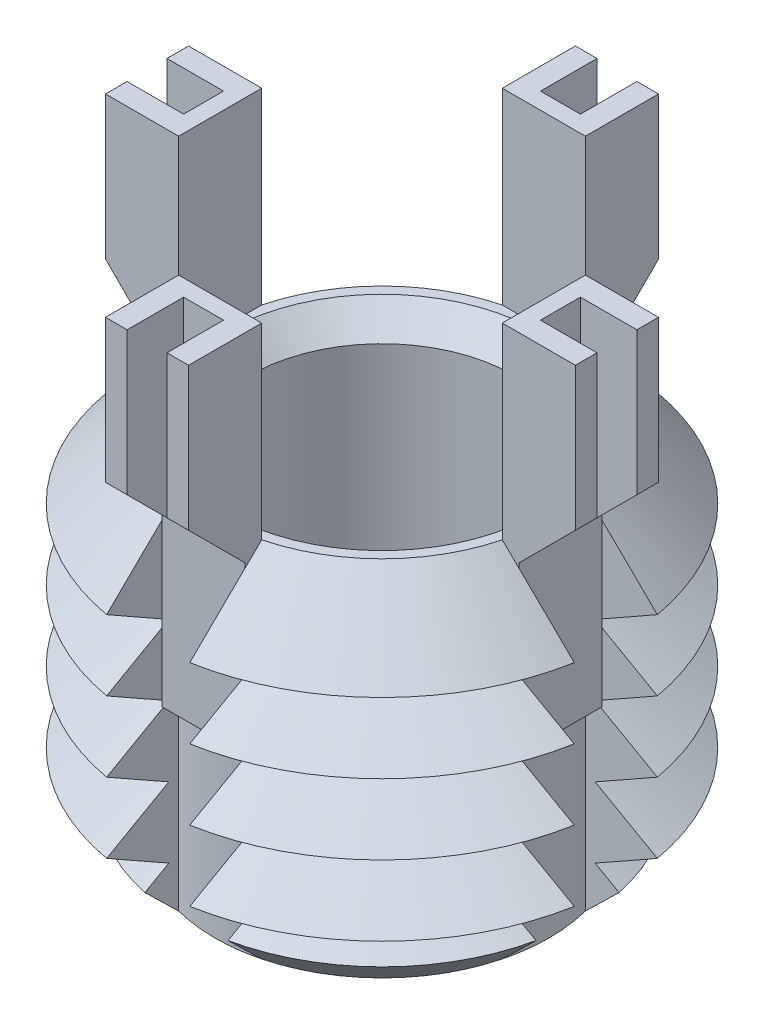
from build123d import *

# Parameters (mm, degrees)
SKETCH1_R               = 7.144
BOSS_EXTRUDE1_DEPTH     = 10.922
CHAMFER1_SIZE           = 2.117
LPATTERN1_COUNT         = 4
LPATTERN1_PITCH         = 2.117
CUT_EXTRUDE1_REACH      = 16.878
CIRPATTERN1_COUNT       = 4
BOSS_EXTRUDE3_DEPTH     = 1.25
CIRPATTERN2_COUNT       = 4
CUT_EXTRUDE3_DEPTH      = 20.353104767
CUT_EXTRUDE3_DEPTH_BACK = 20.353104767
SKETCH6_W               = 1.7
SKETCH6_H               = 1.2
SKETCH6_W_2             = 1.2
SKETCH6_H_2             = 1.7
SKETCH7_R               = 3.969
CUT_EXTRUDE4_DEPTH      = 10.922
CHAMFER2_SIZE           = 0.755


with BuildPart() as part:
    # Sketch1 → Boss-Extrude1 (new body)
    with BuildSketch(Plane(origin=(0, 0, 0), x_dir=(1, 0, 0), z_dir=(0, 1, 0))):
        with Locations(Location((0, 0, 0), (0, 0, 270))):
            Circle(SKETCH1_R)
    extrude(amount=-BOSS_EXTRUDE1_DEPTH)

    # Chamfer1
    chamfer1_edges = [part.edges().sort_by_distance(p)[0] for p in [
        (0, 0, -7.144),
        (0, -10.922, -7.144),
    ]]
    chamfer(chamfer1_edges, length=CHAMFER1_SIZE)

    # Sketch3 → Cut-Revolve1 (revolve, cut)
    with BuildSketch(Plane(origin=(0, 0, 0), x_dir=(0, 0, -1), z_dir=(1, 0, 0))):
        Polygon((-7.144, -2.117), (-5.31062422, -3.1755), (-7.144, -4.234), align=None)
    cut_revolve1 = revolve(axis=Axis((0, 0.885892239, 0), (0, -1, 0)), mode=Mode.SUBTRACT)

    # LPattern1: Cut-Revolve1 ×4
    with Locations(*[(0, -i * LPATTERN1_PITCH, 0) for i in range(1, LPATTERN1_COUNT)]):
        add(cut_revolve1, mode=Mode.SUBTRACT)

    # Cut-Extrude1: up to this cone (the profile starts inside it)
    cut_extrude1_end = Plane(origin=(0, 0, 0), z_dir=(0, 1, 0)).offset(-15.948999) * Cone(1e-06, 49.276, 49.275999, align=(Align.CENTER, Align.CENTER, Align.MIN), mode=Mode.PRIVATE)
    # Sketch4 → Cut-Extrude1 (cut, up to the surface)
    with BuildSketch(Plane(origin=(0, 0, 0), x_dir=(1, 0, 0), z_dir=(0, 1, 0)), mode=Mode.PRIVATE) as cut_extrude1_sk1:
        with BuildLine():
            Line((-4.869109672, 1.25), (-7.033792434, 1.25))
            ThreePointArc((-7.033792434, 1.25), (-7.144, 0), (-7.033792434, -1.25))
            Line((-7.033792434, -1.25), (-4.869109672, -1.25))
            ThreePointArc((-4.869109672, -1.25), (-5.027, 0), (-4.869109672, 1.25))
        make_face()
    cut_extrude1_tool1 = extrude(cut_extrude1_sk1.sketch, amount=-CUT_EXTRUDE1_REACH, mode=Mode.PRIVATE) & cut_extrude1_end
    cut_extrude1 = cut_extrude1_tool1.solids().sort_by_distance((-6.040777, 0, 0))[0]
    add(cut_extrude1, mode=Mode.SUBTRACT)

    # CirPattern1: Cut-Extrude1 ×4 about axis
    cirpattern1_axis = Axis((0, 0, 0), (0, 1, 0))
    for i in range(1, CIRPATTERN1_COUNT):
        add(cut_extrude1.rotate(cirpattern1_axis, i * 360 / CIRPATTERN1_COUNT), mode=Mode.SUBTRACT)

    # Sketch5 → Boss-Extrude3 (add, symmetric)
    with BuildSketch(Plane(origin=(0, 0, 0), x_dir=(0, 0, -1), z_dir=(1, 0, 0))):
        Polygon((-4.869109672, 5.649), (-4.869109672, -5.351), (-5.369109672, -5.351), (-5.369109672, -0.351), (-7.069109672, 1.349), (-7.069109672, 5.649), align=None)
    boss_extrude3 = extrude(amount=BOSS_EXTRUDE3_DEPTH, both=True)

    # CirPattern2: Boss-Extrude3 ×4 about axis
    cirpattern2_axis = Axis((0, 0, 0), (0, 1, 0))
    for i in range(1, CIRPATTERN2_COUNT):
        add(boss_extrude3.rotate(cirpattern2_axis, i * 360 / CIRPATTERN2_COUNT))

    # Sketch6 → Cut-Extrude3 (cut, two sides: drawn at the far end of the back side and taken through both)
    with BuildSketch(Plane(origin=(0, 5.649, 0), x_dir=(1, 0, 0), z_dir=(0, 1, 0)).offset(-CUT_EXTRUDE3_DEPTH_BACK)):
        with Locations((-6.219109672, 0)):
            Rectangle(SKETCH6_W, SKETCH6_H)
        with Locations((0, 6.219109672)):
            Rectangle(SKETCH6_W_2, SKETCH6_H_2)
        with Locations((6.219109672, 0)):
            Rectangle(SKETCH6_W, SKETCH6_H)
        with Locations((0, -6.219109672)):
            Rectangle(SKETCH6_W_2, SKETCH6_H_2)
    extrude(amount=CUT_EXTRUDE3_DEPTH + CUT_EXTRUDE3_DEPTH_BACK, mode=Mode.SUBTRACT)

    # Sketch7 → Cut-Extrude4 (cut)
    with BuildSketch(Plane(origin=(0, 0, 0), x_dir=(1, 0, 0), z_dir=(0, 1, 0))):
        with Locations(Location((0, 0, 0), (0, 0, 270))):
            Circle(SKETCH7_R)
    extrude(amount=-CUT_EXTRUDE4_DEPTH, mode=Mode.SUBTRACT)

    # Chamfer2
    chamfer2_edges = [part.edges().sort_by_distance(p)[0] for p in [
        (0, 0, -3.969),
        (0, -10.922, -3.969),
    ]]
    chamfer(chamfer2_edges, length=CHAMFER2_SIZE)


solid = part.part
